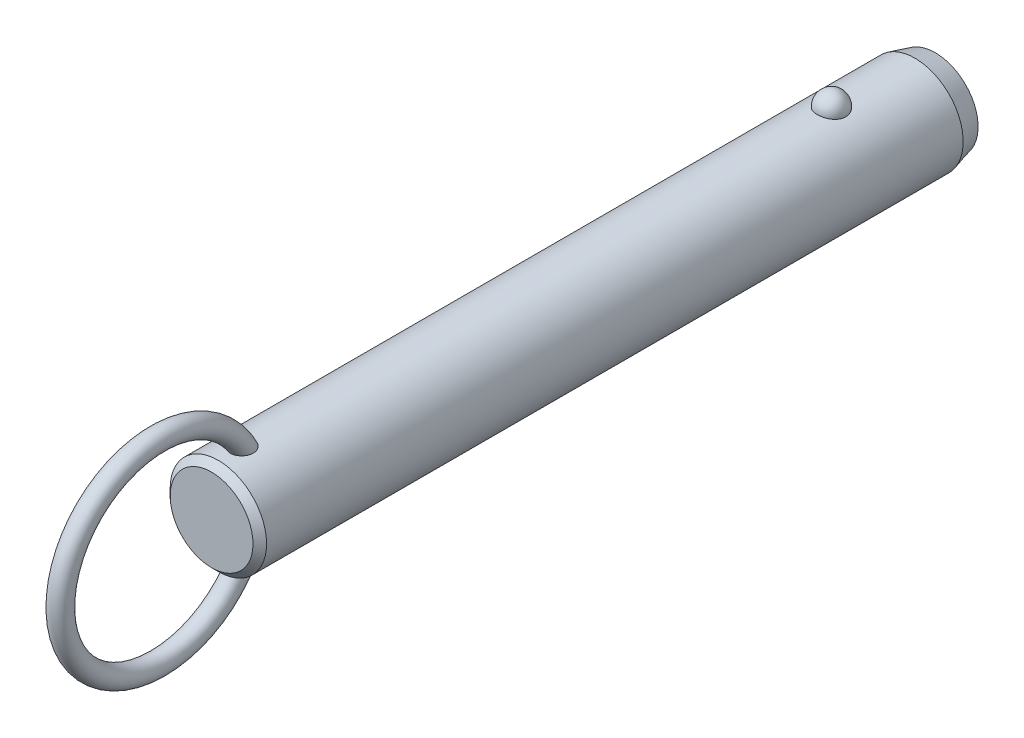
ISO-10303-21;
HEADER;
FILE_DESCRIPTION(('STEP AP214'),'2;1');
FILE_NAME('part.step','',(''),(''),'','','');
FILE_SCHEMA(('AUTOMOTIVE_DESIGN { 1 0 10303 214 1 1 1 1 }'));
ENDSEC;
DATA;
#1=APPLICATION_CONTEXT('core data for automotive mechanical design processes');
#2=APPLICATION_PROTOCOL_DEFINITION('international standard','automotive_design',2000,#1);
#3=PRODUCT_CONTEXT('',#1,'mechanical');
#4=PRODUCT('Part','Part','',(#3));
#5=PRODUCT_RELATED_PRODUCT_CATEGORY('part','',(#4));
#6=PRODUCT_DEFINITION_FORMATION('','',#4);
#7=PRODUCT_DEFINITION_CONTEXT('part definition',#1,'design');
#8=PRODUCT_DEFINITION('design','',#6,#7);
#9=PRODUCT_DEFINITION_SHAPE('','',#8);
#10=(LENGTH_UNIT() NAMED_UNIT(*) SI_UNIT(.MILLI.,.METRE.));
#11=(NAMED_UNIT(*) PLANE_ANGLE_UNIT() SI_UNIT($,.RADIAN.));
#12=(NAMED_UNIT(*) SI_UNIT($,.STERADIAN.) SOLID_ANGLE_UNIT());
#13=UNCERTAINTY_MEASURE_WITH_UNIT(LENGTH_MEASURE(1.E-05),#10,'distance_accuracy_value','');
#14=(GEOMETRIC_REPRESENTATION_CONTEXT(3) GLOBAL_UNCERTAINTY_ASSIGNED_CONTEXT((#13)) GLOBAL_UNIT_ASSIGNED_CONTEXT((#10,
#11,#12)) REPRESENTATION_CONTEXT('',''));
#15=CARTESIAN_POINT('',(0.,0.,0.));
#16=DIRECTION('',(0.,0.,1.));
#17=DIRECTION('',(1.,0.,0.));
#18=AXIS2_PLACEMENT_3D('',#15,#16,#17);
#19=CARTESIAN_POINT('',(0.,0.,81.3));
#20=DIRECTION('',(0.,0.,-1.));
#21=DIRECTION('',(-1.,0.,0.));
#22=AXIS2_PLACEMENT_3D('',#19,#20,#21);
#23=CYLINDRICAL_SURFACE('',#22,7.1);
#24=CARTESIAN_POINT('',(2.0769088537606,6.78943661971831,-2.1));
#25=CARTESIAN_POINT('',(2.07690739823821,6.78943796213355,-1.98268154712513));
#26=CARTESIAN_POINT('',(2.06738130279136,6.79237331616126,-1.86534506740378));
#27=CARTESIAN_POINT('',(2.0295040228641,6.8037853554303,-1.63400788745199));
#28=CARTESIAN_POINT('',(2.00114757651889,6.81226358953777,-1.52000812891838));
#29=CARTESIAN_POINT('',(1.92632025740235,6.83379798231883,-1.29863433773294));
#30=CARTESIAN_POINT('',(1.87985726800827,6.84685214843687,-1.19125744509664));
#31=CARTESIAN_POINT('',(1.76995205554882,6.87608091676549,-0.98604657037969));
#32=CARTESIAN_POINT('',(1.70650980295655,6.8922555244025,-0.88821260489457));
#33=CARTESIAN_POINT('',(1.5638119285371,6.92602930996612,-0.704242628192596));
#34=CARTESIAN_POINT('',(1.4844714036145,6.94363582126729,-0.618173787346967));
#35=CARTESIAN_POINT('',(1.31221746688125,6.97823658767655,-0.460740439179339));
#36=CARTESIAN_POINT('',(1.21930409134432,6.99523084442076,-0.389375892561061));
#37=CARTESIAN_POINT('',(1.02268781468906,7.02666176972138,-0.263547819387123));
#38=CARTESIAN_POINT('',(0.91902009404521,7.04110638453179,-0.209031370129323));
#39=CARTESIAN_POINT('',(0.703548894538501,7.06588726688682,-0.118163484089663));
#40=CARTESIAN_POINT('',(0.591746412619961,7.07622403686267,-0.0818098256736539));
#41=CARTESIAN_POINT('',(0.365557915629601,7.09147068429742,-0.0288711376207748));
#42=CARTESIAN_POINT('',(0.251267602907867,7.09648447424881,-0.0119070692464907));
#43=CARTESIAN_POINT('',(0.0213499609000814,7.10089837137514,0.00304925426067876));
#44=CARTESIAN_POINT('',(-0.0942772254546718,7.10029907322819,0.00104351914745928));
#45=CARTESIAN_POINT('',(-0.321651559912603,7.09360829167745,-0.0216931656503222));
#46=CARTESIAN_POINT('',(-0.433431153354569,7.08760388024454,-0.0421272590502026));
#47=CARTESIAN_POINT('',(-0.651862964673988,7.07086131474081,-0.100729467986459));
#48=CARTESIAN_POINT('',(-0.758515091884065,7.06012307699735,-0.138897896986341));
#49=CARTESIAN_POINT('',(-0.964449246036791,7.03496097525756,-0.232213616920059));
#50=CARTESIAN_POINT('',(-1.06368095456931,7.02051445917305,-0.287465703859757));
#51=CARTESIAN_POINT('',(-1.25145353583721,6.98948740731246,-0.413383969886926));
#52=CARTESIAN_POINT('',(-1.33999321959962,6.97290663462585,-0.48405186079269));
#53=CARTESIAN_POINT('',(-1.50591604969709,6.93898770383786,-0.640594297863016));
#54=CARTESIAN_POINT('',(-1.58302488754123,6.92164094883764,-0.726757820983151));
#55=CARTESIAN_POINT('',(-1.72189320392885,6.8884103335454,-0.91092752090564));
#56=CARTESIAN_POINT('',(-1.78365144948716,6.87252659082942,-1.008934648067));
#57=CARTESIAN_POINT('',(-1.89101272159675,6.84377189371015,-1.21549497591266));
#58=CARTESIAN_POINT('',(-1.93639553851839,6.83094274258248,-1.32416860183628));
#59=CARTESIAN_POINT('',(-2.00874275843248,6.81002070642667,-1.54791500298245));
#60=CARTESIAN_POINT('',(-2.03570774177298,6.80192767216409,-1.66298757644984));
#61=CARTESIAN_POINT('',(-2.07047276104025,6.7914266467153,-1.89571453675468));
#62=CARTESIAN_POINT('',(-2.07835878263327,6.78899315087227,-2.01335491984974));
#63=CARTESIAN_POINT('',(-2.07502083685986,6.79001409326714,-2.24833570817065));
#64=CARTESIAN_POINT('',(-2.06379746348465,6.7934683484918,-2.36567612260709));
#65=CARTESIAN_POINT('',(-2.02263913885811,6.80583442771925,-2.59603194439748));
#66=CARTESIAN_POINT('',(-1.99281127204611,6.81471501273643,-2.70906820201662));
#67=CARTESIAN_POINT('',(-1.91526639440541,6.83691232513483,-2.92836575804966));
#68=CARTESIAN_POINT('',(-1.8675486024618,6.85022924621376,-3.03462676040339));
#69=CARTESIAN_POINT('',(-1.75504492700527,6.87991336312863,-3.23806487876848));
#70=CARTESIAN_POINT('',(-1.69015924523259,6.89629822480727,-3.33518422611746));
#71=CARTESIAN_POINT('',(-1.54505404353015,6.93024852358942,-3.51697105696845));
#72=CARTESIAN_POINT('',(-1.46483385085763,6.94781401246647,-3.60163799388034));
#73=CARTESIAN_POINT('',(-1.29071406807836,6.98225977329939,-3.75654119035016));
#74=CARTESIAN_POINT('',(-1.19675650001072,6.99913673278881,-3.82671308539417));
#75=CARTESIAN_POINT('',(-0.997940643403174,7.03023618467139,-3.9501837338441));
#76=CARTESIAN_POINT('',(-0.89308318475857,7.04445887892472,-4.00348377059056));
#77=CARTESIAN_POINT('',(-0.676902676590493,7.06848365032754,-4.09107242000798));
#78=CARTESIAN_POINT('',(-0.565686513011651,7.0783430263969,-4.12560889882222));
#79=CARTESIAN_POINT('',(-0.338739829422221,7.09282534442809,-4.17575450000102));
#80=CARTESIAN_POINT('',(-0.223009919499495,7.09744899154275,-4.19136617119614));
#81=CARTESIAN_POINT('',(0.00707628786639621,7.10090930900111,-4.20307965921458));
#82=CARTESIAN_POINT('',(0.121410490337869,7.09986531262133,-4.19958377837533));
#83=CARTESIAN_POINT('',(0.347815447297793,7.092380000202,-4.17411564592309));
#84=CARTESIAN_POINT('',(0.459886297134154,7.08593891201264,-4.15214417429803));
#85=CARTESIAN_POINT('',(0.678084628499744,7.06838983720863,-4.09049562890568));
#86=CARTESIAN_POINT('',(0.784237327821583,7.05730369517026,-4.05090137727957));
#87=CARTESIAN_POINT('',(0.988305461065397,7.03163139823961,-3.95511447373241));
#88=CARTESIAN_POINT('',(1.08622031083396,7.01704499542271,-3.89892064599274));
#89=CARTESIAN_POINT('',(1.27284490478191,6.98562668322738,-3.77035541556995));
#90=CARTESIAN_POINT('',(1.36137372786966,6.96876135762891,-3.69772964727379));
#91=CARTESIAN_POINT('',(1.52509486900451,6.93477412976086,-3.53878279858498));
#92=CARTESIAN_POINT('',(1.60028496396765,6.91765218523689,-3.45245943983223));
#93=CARTESIAN_POINT('',(1.73681688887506,6.88465753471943,-3.26658774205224));
#94=CARTESIAN_POINT('',(1.79785966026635,6.86881574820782,-3.16681408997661));
#95=CARTESIAN_POINT('',(1.90265327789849,6.84053157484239,-2.95814408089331));
#96=CARTESIAN_POINT('',(1.94640861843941,6.82808830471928,-2.84925010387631));
#97=CARTESIAN_POINT('',(2.01274378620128,6.80881460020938,-2.63454318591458));
#98=CARTESIAN_POINT('',(2.03676193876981,6.80160856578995,-2.52920574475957));
#99=CARTESIAN_POINT('',(2.06884490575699,6.79191902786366,-2.3159172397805));
#100=CARTESIAN_POINT('',(2.07691019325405,6.78943538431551,-2.20796625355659));
#101=CARTESIAN_POINT('',(2.0769088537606,6.78943661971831,-2.1));
#102=B_SPLINE_CURVE_WITH_KNOTS('',3,(#24,#25,#26,#27,#28,#29,#30,#31,#32,#33,#34,#35,#36,#37,
#38,#39,#40,#41,#42,#43,#44,#45,#46,#47,#48,#49,#50,#51,#52,#53,#54,#55,#56,#57,#58,#59,#60,#61,
#62,#63,#64,#65,#66,#67,#68,#69,#70,#71,#72,#73,#74,#75,#76,#77,#78,#79,#80,#81,#82,#83,#84,#85,
#86,#87,#88,#89,#90,#91,#92,#93,#94,#95,#96,#97,#98,#99,#100,#101),.UNSPECIFIED.,.T.,.F.,(4,2,2,
2,2,2,2,2,2,2,2,2,2,2,2,2,2,2,2,2,2,2,2,2,2,2,2,2,2,2,2,2,2,2,2,2,2,2,4),(0.,0.351568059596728,
0.703234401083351,1.05474780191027,1.40626181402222,1.75970563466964,2.11314851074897,
2.4654696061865,2.81774759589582,3.16301449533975,3.50824481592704,3.84801136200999,
4.18778391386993,4.52968352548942,4.87162112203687,5.22076181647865,5.56993054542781,
5.92363364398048,6.27732559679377,6.62942052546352,6.98150450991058,7.33158042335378,
7.68167162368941,8.03384443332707,8.38603269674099,8.73975272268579,9.09344583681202,
9.44234545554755,9.79119807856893,10.1327344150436,10.4742563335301,10.8141898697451,
11.1541474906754,11.4997793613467,11.8454687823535,12.1979079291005,12.5502553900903,
12.8738073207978,13.1973496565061),.UNSPECIFIED.);
#103=CARTESIAN_POINT('',(2.0769088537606,6.78943661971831,-2.1));
#104=VERTEX_POINT('',#103);
#105=EDGE_CURVE('E41',#104,#104,#102,.T.);
#106=ORIENTED_EDGE('',*,*,#105,.T.);
#107=EDGE_LOOP('',(#106));
#108=FACE_BOUND('',#107,.T.);
#109=CARTESIAN_POINT('',(0.,0.,88.22));
#110=DIRECTION('',(0.,0.,1.));
#111=DIRECTION('',(1.,0.,0.));
#112=AXIS2_PLACEMENT_3D('',#109,#110,#111);
#113=CIRCLE('',#112,7.1);
#114=CARTESIAN_POINT('',(7.1,0.,88.22));
#115=VERTEX_POINT('',#114);
#116=EDGE_CURVE('E10',#115,#115,#113,.F.);
#117=ORIENTED_EDGE('',*,*,#116,.T.);
#118=EDGE_LOOP('',(#117));
#119=FACE_BOUND('',#118,.T.);
#120=CARTESIAN_POINT('',(-0.429539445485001,-7.08699541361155,83.0429212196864));
#121=CARTESIAN_POINT('',(-0.508331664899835,-7.08221999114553,83.0668764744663));
#122=CARTESIAN_POINT('',(-0.585039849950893,-7.07624016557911,83.0974570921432));
#123=CARTESIAN_POINT('',(-0.732082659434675,-7.06254296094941,83.1710242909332));
#124=CARTESIAN_POINT('',(-0.802417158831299,-7.05482554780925,83.2140111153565));
#125=CARTESIAN_POINT('',(-0.934722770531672,-7.03851844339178,83.3111135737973));
#126=CARTESIAN_POINT('',(-0.996700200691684,-7.02992941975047,83.3652207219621));
#127=CARTESIAN_POINT('',(-1.11079942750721,-7.01280697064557,83.4829676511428));
#128=CARTESIAN_POINT('',(-1.16292136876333,-7.00427354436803,83.5466072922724));
#129=CARTESIAN_POINT('',(-1.25705660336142,-6.98799959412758,83.6826870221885));
#130=CARTESIAN_POINT('',(-1.29888032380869,-6.98027525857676,83.7552598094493));
#131=CARTESIAN_POINT('',(-1.37069920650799,-6.96652886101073,83.9061686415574));
#132=CARTESIAN_POINT('',(-1.40069157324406,-6.96050720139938,83.9845060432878));
#133=CARTESIAN_POINT('',(-1.45043507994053,-6.95031881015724,84.1501903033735));
#134=CARTESIAN_POINT('',(-1.46937115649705,-6.94630231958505,84.2377897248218));
#135=CARTESIAN_POINT('',(-1.49424917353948,-6.94099239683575,84.4148714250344));
#136=CARTESIAN_POINT('',(-1.50018601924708,-6.93970003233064,84.5043544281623));
#137=CARTESIAN_POINT('',(-1.49978214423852,-6.93978815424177,84.6940607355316));
#138=CARTESIAN_POINT('',(-1.49187639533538,-6.94150934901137,84.794279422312));
#139=CARTESIAN_POINT('',(-1.46177925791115,-6.94790814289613,84.9924798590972));
#140=CARTESIAN_POINT('',(-1.43957541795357,-6.95258831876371,85.090459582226));
#141=CARTESIAN_POINT('',(-1.37783293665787,-6.96510647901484,85.2953629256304));
#142=CARTESIAN_POINT('',(-1.33634073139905,-6.97328848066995,85.4016801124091));
#143=CARTESIAN_POINT('',(-1.23686994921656,-6.99161706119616,85.6061777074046));
#144=CARTESIAN_POINT('',(-1.17889192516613,-7.00176357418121,85.7043583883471));
#145=CARTESIAN_POINT('',(-1.0587512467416,-7.02082898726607,85.8723743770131));
#146=CARTESIAN_POINT('',(-0.999247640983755,-7.02963746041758,85.9441230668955));
#147=CARTESIAN_POINT('',(-0.869494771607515,-7.04686074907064,86.0771959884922));
#148=CARTESIAN_POINT('',(-0.799263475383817,-7.05527619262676,86.1385372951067));
#149=CARTESIAN_POINT('',(-0.665408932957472,-7.06899457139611,86.2351316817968));
#150=CARTESIAN_POINT('',(-0.603817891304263,-7.07457275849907,86.2731512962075));
#151=CARTESIAN_POINT('',(-0.475172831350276,-7.08437420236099,86.3387581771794));
#152=CARTESIAN_POINT('',(-0.408123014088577,-7.08859848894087,86.3663533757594));
#153=CARTESIAN_POINT('',(-0.269431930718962,-7.09522749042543,86.4092569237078));
#154=CARTESIAN_POINT('',(-0.197757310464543,-7.09761688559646,86.4244618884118));
#155=CARTESIAN_POINT('',(-0.0527849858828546,-7.10017268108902,86.4407168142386));
#156=CARTESIAN_POINT('',(0.0205115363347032,-7.10034065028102,86.4417767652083));
#157=CARTESIAN_POINT('',(0.156426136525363,-7.09855986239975,86.4304619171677));
#158=CARTESIAN_POINT('',(0.219199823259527,-7.09688191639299,86.4198060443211));
#159=CARTESIAN_POINT('',(0.342134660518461,-7.09201880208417,86.3885379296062));
#160=CARTESIAN_POINT('',(0.402295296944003,-7.08883333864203,86.3679237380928));
#161=CARTESIAN_POINT('',(0.52068738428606,-7.08113868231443,86.3172125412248));
#162=CARTESIAN_POINT('',(0.578791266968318,-7.07658958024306,86.2868272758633));
#163=CARTESIAN_POINT('',(0.690173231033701,-7.06659708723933,86.2183678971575));
#164=CARTESIAN_POINT('',(0.743447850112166,-7.061153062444,86.1802883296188));
#165=CARTESIAN_POINT('',(0.87094790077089,-7.04680292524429,86.0765929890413));
#166=CARTESIAN_POINT('',(0.941828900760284,-7.0375580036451,86.0068972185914));
#167=CARTESIAN_POINT('',(1.07136606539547,-7.01900793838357,85.8569450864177));
#168=CARTESIAN_POINT('',(1.13000013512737,-7.00970271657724,85.7766700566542));
#169=CARTESIAN_POINT('',(1.23579584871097,-6.99183327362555,85.6068997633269));
#170=CARTESIAN_POINT('',(1.28274271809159,-6.98328455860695,85.5172696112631));
#171=CARTESIAN_POINT('',(1.36351442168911,-6.96796352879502,85.3321763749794));
#172=CARTESIAN_POINT('',(1.39733971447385,-6.96119115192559,85.2367134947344));
#173=CARTESIAN_POINT('',(1.45579181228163,-6.94922464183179,85.0253092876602));
#174=CARTESIAN_POINT('',(1.47790145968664,-6.94449000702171,84.908631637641));
#175=CARTESIAN_POINT('',(1.50168752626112,-6.93938731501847,84.6730153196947));
#176=CARTESIAN_POINT('',(1.50336085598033,-6.93901991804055,84.5540763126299));
#177=CARTESIAN_POINT('',(1.48486516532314,-6.9430010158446,84.3236079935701));
#178=CARTESIAN_POINT('',(1.46573441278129,-6.9471253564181,84.2119958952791));
#179=CARTESIAN_POINT('',(1.40606892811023,-6.95944667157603,83.9948868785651));
#180=CARTESIAN_POINT('',(1.3655644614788,-6.96763788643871,83.8893815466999));
#181=CARTESIAN_POINT('',(1.27082700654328,-6.98548038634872,83.7042879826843));
#182=CARTESIAN_POINT('',(1.21949810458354,-6.99473841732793,83.6231719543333));
#183=CARTESIAN_POINT('',(1.10242050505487,-7.01414069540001,83.4722278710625));
#184=CARTESIAN_POINT('',(1.03668119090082,-7.02428436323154,83.4023925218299));
#185=CARTESIAN_POINT('',(0.900559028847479,-7.04295285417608,83.2835735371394));
#186=CARTESIAN_POINT('',(0.831428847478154,-7.05153466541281,83.2331573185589));
#187=CARTESIAN_POINT('',(0.685291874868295,-7.06723150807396,83.1451429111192));
#188=CARTESIAN_POINT('',(0.608287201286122,-7.0743469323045,83.1075412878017));
#189=CARTESIAN_POINT('',(0.451878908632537,-7.08602232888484,83.0474915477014));
#190=CARTESIAN_POINT('',(0.372686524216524,-7.09067127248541,83.0245088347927));
#191=CARTESIAN_POINT('',(0.211477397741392,-7.09730788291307,82.9920357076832));
#192=CARTESIAN_POINT('',(0.129460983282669,-7.09929585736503,82.9825437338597));
#193=CARTESIAN_POINT('',(-0.0332905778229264,-7.10037858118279,82.9773517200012));
#194=CARTESIAN_POINT('',(-0.114016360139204,-7.09953334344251,82.9813656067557));
#195=CARTESIAN_POINT('',(-0.273670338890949,-7.09517338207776,83.0024540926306));
#196=CARTESIAN_POINT('',(-0.352598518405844,-7.09165863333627,83.0195288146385));
#197=CARTESIAN_POINT('',(-0.429539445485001,-7.08699541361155,83.0429212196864));
#198=B_SPLINE_CURVE_WITH_KNOTS('',3,(#120,#121,#122,#123,#124,#125,#126,#127,#128,#129,#130,
#131,#132,#133,#134,#135,#136,#137,#138,#139,#140,#141,#142,#143,#144,#145,#146,#147,#148,#149,
#150,#151,#152,#153,#154,#155,#156,#157,#158,#159,#160,#161,#162,#163,#164,#165,#166,#167,#168,
#169,#170,#171,#172,#173,#174,#175,#176,#177,#178,#179,#180,#181,#182,#183,#184,#185,#186,#187,
#188,#189,#190,#191,#192,#193,#194,#195,#196,#197),.UNSPECIFIED.,.T.,.F.,(4,2,2,2,2,2,2,2,2,2,2,
2,2,2,2,2,2,2,2,2,2,2,2,2,2,2,2,2,2,2,2,2,2,2,2,2,2,2,4),(0.,0.247183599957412,0.49437204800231,
0.741372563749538,0.988369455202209,1.23962059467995,1.49093106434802,1.75897818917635,
2.02713035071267,2.32758265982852,2.62829697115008,2.97008736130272,3.31186629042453,
3.59175319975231,3.87117637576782,4.08813841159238,4.30493502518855,4.52352259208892,
4.74195577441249,4.93215328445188,5.12238804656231,5.31884850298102,5.51544871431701,
5.81332317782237,6.11173048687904,6.41527266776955,6.71880423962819,7.07358156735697,
7.42841252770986,7.76631485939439,8.10373999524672,8.39142246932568,8.67891817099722,
8.93560332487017,9.19221962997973,9.43881106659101,9.68537399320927,9.92674752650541,
10.1681233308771),.UNSPECIFIED.);
#199=CARTESIAN_POINT('',(-0.429539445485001,-7.08699541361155,83.0429212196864));
#200=VERTEX_POINT('',#199);
#201=EDGE_CURVE('E59',#200,#200,#198,.T.);
#202=ORIENTED_EDGE('',*,*,#201,.T.);
#203=EDGE_LOOP('',(#202));
#204=FACE_BOUND('',#203,.T.);
#205=CARTESIAN_POINT('',(-0.429539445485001,7.08699541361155,83.0429212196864));
#206=CARTESIAN_POINT('',(-0.351665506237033,7.09171429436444,83.0192469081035));
#207=CARTESIAN_POINT('',(-0.271733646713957,7.09525896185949,83.0020369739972));
#208=CARTESIAN_POINT('',(-0.110026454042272,7.09960839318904,82.9810059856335));
#209=CARTESIAN_POINT('',(-0.028250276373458,7.10041187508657,82.977191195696));
#210=CARTESIAN_POINT('',(0.134782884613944,7.09918849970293,82.983059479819));
#211=CARTESIAN_POINT('',(0.216039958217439,7.09716214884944,82.9927401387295));
#212=CARTESIAN_POINT('',(0.375730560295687,7.09050177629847,83.0253471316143));
#213=CARTESIAN_POINT('',(0.454164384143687,7.08586802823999,83.0482720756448));
#214=CARTESIAN_POINT('',(0.60602533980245,7.07449911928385,83.106771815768));
#215=CARTESIAN_POINT('',(0.679451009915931,7.06776334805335,83.1423502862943));
#216=CARTESIAN_POINT('',(0.819234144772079,7.05292866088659,83.2251753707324));
#217=CARTESIAN_POINT('',(0.88559181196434,7.04482978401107,83.2724216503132));
#218=CARTESIAN_POINT('',(1.00993211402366,7.02808709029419,83.3775902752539));
#219=CARTESIAN_POINT('',(1.06785399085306,7.01943990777,83.435583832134));
#220=CARTESIAN_POINT('',(1.17342527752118,7.00256662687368,83.5603013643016));
#221=CARTESIAN_POINT('',(1.22107408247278,6.99434055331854,83.6270258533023));
#222=CARTESIAN_POINT('',(1.30652927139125,6.97889183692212,83.7693622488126));
#223=CARTESIAN_POINT('',(1.34399711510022,6.97170674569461,83.8451808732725));
#224=CARTESIAN_POINT('',(1.40682616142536,6.95930080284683,84.0018100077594));
#225=CARTESIAN_POINT('',(1.43218374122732,6.95408053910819,84.0826220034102));
#226=CARTESIAN_POINT('',(1.47246409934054,6.94566853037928,84.2535314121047));
#227=CARTESIAN_POINT('',(1.48642590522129,6.9426653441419,84.3438630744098));
#228=CARTESIAN_POINT('',(1.5011410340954,6.93949744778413,84.525619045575));
#229=CARTESIAN_POINT('',(1.50188917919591,6.93933385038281,84.6170437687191));
#230=CARTESIAN_POINT('',(1.49030464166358,6.94183245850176,84.8108438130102));
#231=CARTESIAN_POINT('',(1.47627413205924,6.94486147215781,84.913112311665));
#232=CARTESIAN_POINT('',(1.43356351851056,6.95380194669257,85.1144719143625));
#233=CARTESIAN_POINT('',(1.4048676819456,6.95971650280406,85.2135594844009));
#234=CARTESIAN_POINT('',(1.32908750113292,6.97461208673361,85.4189087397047));
#235=CARTESIAN_POINT('',(1.28011435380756,6.98388945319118,85.5244566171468));
#236=CARTESIAN_POINT('',(1.16520357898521,7.00397743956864,85.7257604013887));
#237=CARTESIAN_POINT('',(1.09927694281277,7.01478706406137,85.8215225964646));
#238=CARTESIAN_POINT('',(0.969361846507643,7.03373936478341,85.9767565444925));
#239=CARTESIAN_POINT('',(0.909042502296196,7.04187023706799,86.0393032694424));
#240=CARTESIAN_POINT('',(0.779178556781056,7.05741732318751,86.1540535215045));
#241=CARTESIAN_POINT('',(0.709649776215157,7.06483472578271,86.2062744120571));
#242=CARTESIAN_POINT('',(0.576854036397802,7.0767751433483,86.2881138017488));
#243=CARTESIAN_POINT('',(0.515118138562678,7.08158033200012,86.3201641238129));
#244=CARTESIAN_POINT('',(0.387127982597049,7.08972701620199,86.3737656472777));
#245=CARTESIAN_POINT('',(0.320877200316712,7.09306962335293,86.3953248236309));
#246=CARTESIAN_POINT('',(0.185041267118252,7.09791507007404,86.4264005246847));
#247=CARTESIAN_POINT('',(0.115437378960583,7.09940591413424,86.4358385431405));
#248=CARTESIAN_POINT('',(-0.0243157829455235,7.10030171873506,86.4415226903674));
#249=CARTESIAN_POINT('',(-0.0944648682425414,7.0997073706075,86.4377731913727));
#250=CARTESIAN_POINT('',(-0.225713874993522,7.09668414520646,86.4185081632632));
#251=CARTESIAN_POINT('',(-0.28700675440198,7.09444865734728,86.4042323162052));
#252=CARTESIAN_POINT('',(-0.406555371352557,7.08860360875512,86.3663685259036));
#253=CARTESIAN_POINT('',(-0.464809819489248,7.08499346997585,86.3427766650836));
#254=CARTESIAN_POINT('',(-0.594955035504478,7.07541654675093,86.2789232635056));
#255=CARTESIAN_POINT('',(-0.665389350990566,7.06906574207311,86.235753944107));
#256=CARTESIAN_POINT('',(-0.798242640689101,7.05530261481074,86.138587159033));
#257=CARTESIAN_POINT('',(-0.860645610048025,7.0478882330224,86.0845686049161));
#258=CARTESIAN_POINT('',(-0.994249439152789,7.03045217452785,85.9509965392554));
#259=CARTESIAN_POINT('',(-1.06260129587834,7.02030745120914,85.8686143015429));
#260=CARTESIAN_POINT('',(-1.18502045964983,7.00068382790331,85.693843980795));
#261=CARTESIAN_POINT('',(-1.23907684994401,6.99120544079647,85.601448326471));
#262=CARTESIAN_POINT('',(-1.33335589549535,6.97384343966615,85.4080085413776));
#263=CARTESIAN_POINT('',(-1.3733613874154,6.96598557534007,85.3068564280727));
#264=CARTESIAN_POINT('',(-1.43770677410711,6.9529905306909,85.0995046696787));
#265=CARTESIAN_POINT('',(-1.46204473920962,6.94785368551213,84.99330440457));
#266=CARTESIAN_POINT('',(-1.49537533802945,6.94076296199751,84.7682317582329));
#267=CARTESIAN_POINT('',(-1.50273564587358,6.93914842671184,84.6490975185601));
#268=CARTESIAN_POINT('',(-1.4954555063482,6.94072368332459,84.4114703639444));
#269=CARTESIAN_POINT('',(-1.48082914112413,6.94391040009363,84.2929770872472));
#270=CARTESIAN_POINT('',(-1.43076401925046,6.95438579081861,84.0734325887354));
#271=CARTESIAN_POINT('',(-1.39762227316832,6.96121852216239,83.9718413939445));
#272=CARTESIAN_POINT('',(-1.31211274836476,6.97783941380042,83.7773513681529));
#273=CARTESIAN_POINT('',(-1.2597660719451,6.98762432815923,83.6844431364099));
#274=CARTESIAN_POINT('',(-1.14583073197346,7.00713153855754,83.5241601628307));
#275=CARTESIAN_POINT('',(-1.0866594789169,7.01665982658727,83.4550351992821));
#276=CARTESIAN_POINT('',(-0.956606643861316,7.03556646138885,83.3288786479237));
#277=CARTESIAN_POINT('',(-0.885737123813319,7.04494495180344,83.2718347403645));
#278=CARTESIAN_POINT('',(-0.751558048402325,7.06035735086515,83.1831004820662));
#279=CARTESIAN_POINT('',(-0.690120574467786,7.0666695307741,83.1485932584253));
#280=CARTESIAN_POINT('',(-0.562815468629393,7.07794609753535,83.0887507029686));
#281=CARTESIAN_POINT('',(-0.49694844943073,7.08291067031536,83.0634141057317));
#282=CARTESIAN_POINT('',(-0.429539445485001,7.08699541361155,83.0429212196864));
#283=B_SPLINE_CURVE_WITH_KNOTS('',3,(#205,#206,#207,#208,#209,#210,#211,#212,#213,#214,#215,
#216,#217,#218,#219,#220,#221,#222,#223,#224,#225,#226,#227,#228,#229,#230,#231,#232,#233,#234,
#235,#236,#237,#238,#239,#240,#241,#242,#243,#244,#245,#246,#247,#248,#249,#250,#251,#252,#253,
#254,#255,#256,#257,#258,#259,#260,#261,#262,#263,#264,#265,#266,#267,#268,#269,#270,#271,#272,
#273,#274,#275,#276,#277,#278,#279,#280,#281,#282),.UNSPECIFIED.,.T.,.F.,(4,2,2,2,2,2,2,2,2,2,2,
2,2,2,2,2,2,2,2,2,2,2,2,2,2,2,2,2,2,2,2,2,2,2,2,2,2,2,4),(0.,0.244335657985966,
0.488785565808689,0.733191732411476,0.977572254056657,1.22202379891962,1.46646834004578,
1.71259457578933,1.95873529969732,2.21226768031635,2.46587585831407,2.73913816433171,
3.01250754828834,3.32109936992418,3.63002293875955,3.9786351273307,4.32702187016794,
4.58793945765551,4.84841449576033,5.05676704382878,5.26496096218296,5.47449661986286,
5.68396281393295,5.8720544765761,6.06022532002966,6.30743751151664,6.55513496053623,
6.87602468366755,7.19715875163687,7.52305774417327,7.84899686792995,8.20516155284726,
8.56109821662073,8.88040084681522,9.19935367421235,9.4723628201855,9.74509220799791,
9.95662250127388,10.1681235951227),.UNSPECIFIED.);
#284=CARTESIAN_POINT('',(-0.429539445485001,7.08699541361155,83.0429212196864));
#285=VERTEX_POINT('',#284);
#286=EDGE_CURVE('E67',#285,#285,#283,.T.);
#287=ORIENTED_EDGE('',*,*,#286,.T.);
#288=EDGE_LOOP('',(#287));
#289=FACE_BOUND('',#288,.T.);
#290=CARTESIAN_POINT('',(0.,0.,-14.4));
#291=DIRECTION('',(0.,0.,-1.));
#292=DIRECTION('',(-1.,0.,0.));
#293=AXIS2_PLACEMENT_3D('',#290,#291,#292);
#294=CIRCLE('',#293,7.1);
#295=CARTESIAN_POINT('',(-7.1,0.,-14.4));
#296=VERTEX_POINT('',#295);
#297=EDGE_CURVE('E56',#296,#296,#294,.F.);
#298=ORIENTED_EDGE('',*,*,#297,.T.);
#299=EDGE_LOOP('',(#298));
#300=FACE_BOUND('',#299,.T.);
#301=ADVANCED_FACE('F37',(#108,#119,#204,#289,#300),#23,.T.);
#302=CARTESIAN_POINT('',(0.,0.,-17.4));
#303=DIRECTION('',(0.,0.,-1.));
#304=DIRECTION('',(-1.,0.,0.));
#305=AXIS2_PLACEMENT_3D('',#302,#303,#304);
#306=PLANE('',#305);
#307=CARTESIAN_POINT('',(0.,0.,-17.4));
#308=DIRECTION('',(0.,0.,-1.));
#309=DIRECTION('',(-1.,0.,0.));
#310=AXIS2_PLACEMENT_3D('',#307,#308,#309);
#311=CIRCLE('',#310,6.29615242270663);
#312=CARTESIAN_POINT('',(-6.29615242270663,0.,-17.4));
#313=VERTEX_POINT('',#312);
#314=EDGE_CURVE('E66',#313,#313,#311,.T.);
#315=ORIENTED_EDGE('',*,*,#314,.T.);
#316=EDGE_LOOP('',(#315));
#317=FACE_BOUND('',#316,.T.);
#318=ADVANCED_FACE('F85',(#317),#306,.T.);
#319=CARTESIAN_POINT('',(0.,0.,-17.4));
#320=DIRECTION('',(0.,0.,1.));
#321=DIRECTION('',(1.,0.,0.));
#322=AXIS2_PLACEMENT_3D('',#319,#320,#321);
#323=CONICAL_SURFACE('',#322,6.29615242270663,0.261799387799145);
#324=ORIENTED_EDGE('',*,*,#297,.F.);
#325=EDGE_LOOP('',(#324));
#326=FACE_BOUND('',#325,.T.);
#327=ORIENTED_EDGE('',*,*,#314,.F.);
#328=EDGE_LOOP('',(#327));
#329=FACE_BOUND('',#328,.T.);
#330=ADVANCED_FACE('F83',(#326,#329),#323,.T.);
#331=CARTESIAN_POINT('',(0.,0.,89.22));
#332=DIRECTION('',(0.,0.,1.));
#333=DIRECTION('',(1.,0.,0.));
#334=AXIS2_PLACEMENT_3D('',#331,#332,#333);
#335=PLANE('',#334);
#336=CARTESIAN_POINT('',(0.,0.,89.22));
#337=DIRECTION('',(0.,0.,1.));
#338=DIRECTION('',(1.,0.,0.));
#339=AXIS2_PLACEMENT_3D('',#336,#337,#338);
#340=CIRCLE('',#339,6.10000000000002);
#341=CARTESIAN_POINT('',(6.10000000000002,0.,89.22));
#342=VERTEX_POINT('',#341);
#343=EDGE_CURVE('E50',#342,#342,#340,.T.);
#344=ORIENTED_EDGE('',*,*,#343,.T.);
#345=EDGE_LOOP('',(#344));
#346=FACE_BOUND('',#345,.T.);
#347=ADVANCED_FACE('F77',(#346),#335,.T.);
#348=CARTESIAN_POINT('',(0.,0.,97.15));
#349=DIRECTION('',(1.,0.,0.));
#350=DIRECTION('',(0.,0.,-1.));
#351=AXIS2_PLACEMENT_3D('',#348,#349,#350);
#352=TOROIDAL_SURFACE('',#351,14.35,1.5);
#353=ORIENTED_EDGE('',*,*,#286,.F.);
#354=EDGE_LOOP('',(#353));
#355=FACE_BOUND('',#354,.T.);
#356=ORIENTED_EDGE('',*,*,#201,.F.);
#357=EDGE_LOOP('',(#356));
#358=FACE_BOUND('',#357,.T.);
#359=ADVANCED_FACE('F73',(#355,#358),#352,.T.);
#360=CARTESIAN_POINT('',(0.,0.,89.22));
#361=DIRECTION('',(0.,0.,-1.));
#362=DIRECTION('',(-1.,0.,0.));
#363=AXIS2_PLACEMENT_3D('',#360,#361,#362);
#364=CONICAL_SURFACE('',#363,6.10000000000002,0.785398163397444);
#365=ORIENTED_EDGE('',*,*,#116,.F.);
#366=EDGE_LOOP('',(#365));
#367=FACE_BOUND('',#366,.T.);
#368=ORIENTED_EDGE('',*,*,#343,.F.);
#369=EDGE_LOOP('',(#368));
#370=FACE_BOUND('',#369,.T.);
#371=ADVANCED_FACE('F39',(#367,#370),#364,.T.);
#372=CARTESIAN_POINT('',(0.,7.1,-2.1));
#373=DIRECTION('',(0.,1.,0.));
#374=DIRECTION('',(0.,0.,1.));
#375=AXIS2_PLACEMENT_3D('',#372,#373,#374);
#376=SPHERICAL_SURFACE('',#375,2.10000000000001);
#377=ORIENTED_EDGE('',*,*,#105,.F.);
#378=EDGE_LOOP('',(#377));
#379=FACE_BOUND('',#378,.T.);
#380=ADVANCED_FACE('F79',(#379),#376,.T.);
#381=CLOSED_SHELL('',(#301,#318,#330,#347,#359,#371,#380));
#382=MANIFOLD_SOLID_BREP('B2',#381);
#383=ADVANCED_BREP_SHAPE_REPRESENTATION('',(#18,#382),#14);
#384=SHAPE_DEFINITION_REPRESENTATION(#9,#383);
ENDSEC;
END-ISO-10303-21;
